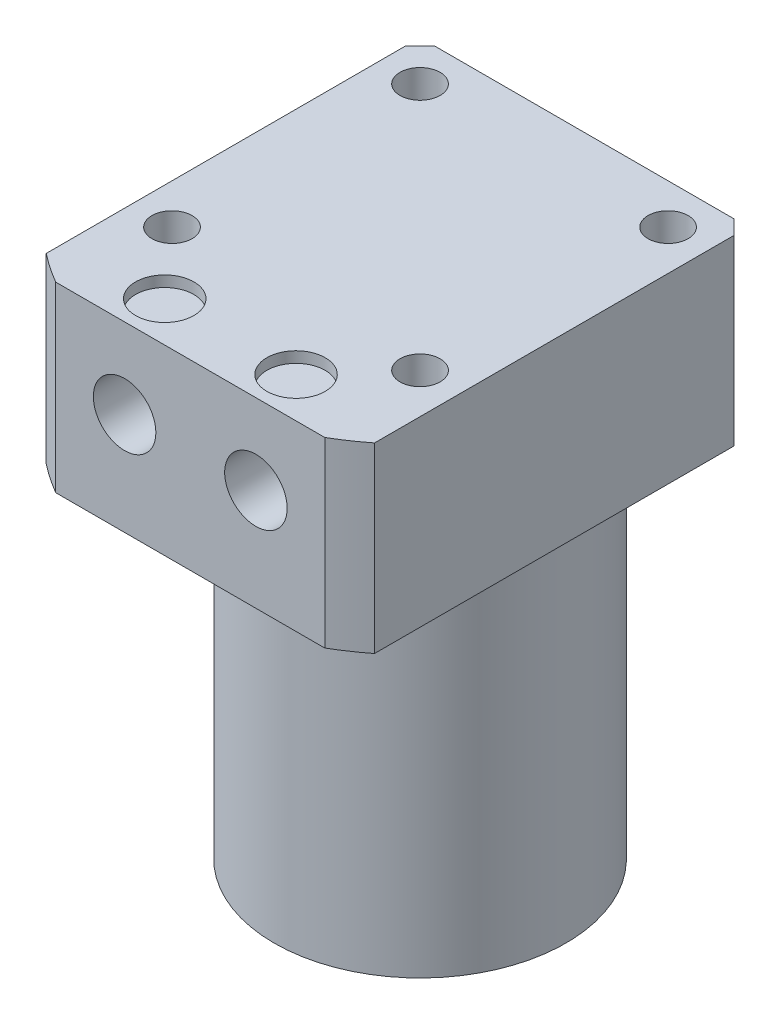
ISO-10303-21;
HEADER;
FILE_DESCRIPTION(('STEP AP214'),'2;1');
FILE_NAME('part.step','',(''),(''),'','','');
FILE_SCHEMA(('AUTOMOTIVE_DESIGN { 1 0 10303 214 1 1 1 1 }'));
ENDSEC;
DATA;
#1=APPLICATION_CONTEXT('core data for automotive mechanical design processes');
#2=APPLICATION_PROTOCOL_DEFINITION('international standard','automotive_design',2000,#1);
#3=PRODUCT_CONTEXT('',#1,'mechanical');
#4=PRODUCT('Part','Part','',(#3));
#5=PRODUCT_RELATED_PRODUCT_CATEGORY('part','',(#4));
#6=PRODUCT_DEFINITION_FORMATION('','',#4);
#7=PRODUCT_DEFINITION_CONTEXT('part definition',#1,'design');
#8=PRODUCT_DEFINITION('design','',#6,#7);
#9=PRODUCT_DEFINITION_SHAPE('','',#8);
#10=(LENGTH_UNIT() NAMED_UNIT(*) SI_UNIT(.MILLI.,.METRE.));
#11=(NAMED_UNIT(*) PLANE_ANGLE_UNIT() SI_UNIT($,.RADIAN.));
#12=(NAMED_UNIT(*) SI_UNIT($,.STERADIAN.) SOLID_ANGLE_UNIT());
#13=UNCERTAINTY_MEASURE_WITH_UNIT(LENGTH_MEASURE(1.E-05),#10,'distance_accuracy_value','');
#14=(GEOMETRIC_REPRESENTATION_CONTEXT(3) GLOBAL_UNCERTAINTY_ASSIGNED_CONTEXT((#13)) GLOBAL_UNIT_ASSIGNED_CONTEXT((#10,
#11,#12)) REPRESENTATION_CONTEXT('',''));
#15=CARTESIAN_POINT('',(0.,0.,0.));
#16=DIRECTION('',(0.,0.,1.));
#17=DIRECTION('',(1.,0.,0.));
#18=AXIS2_PLACEMENT_3D('',#15,#16,#17);
#19=CARTESIAN_POINT('',(-20.,50.,0.));
#20=DIRECTION('',(0.,-1.,0.));
#21=DIRECTION('',(0.,0.,-1.));
#22=AXIS2_PLACEMENT_3D('',#19,#20,#21);
#23=PLANE('',#22);
#24=CARTESIAN_POINT('',(-17.,50.,-17.));
#25=DIRECTION('',(0.,-1.,0.));
#26=DIRECTION('',(0.,0.,-1.));
#27=AXIS2_PLACEMENT_3D('',#24,#25,#26);
#28=CIRCLE('',#27,2.75);
#29=CARTESIAN_POINT('',(-17.,50.,-19.75));
#30=VERTEX_POINT('',#29);
#31=EDGE_CURVE('E288',#30,#30,#28,.T.);
#32=ORIENTED_EDGE('',*,*,#31,.F.);
#33=EDGE_LOOP('',(#32));
#34=FACE_BOUND('',#33,.T.);
#35=CARTESIAN_POINT('',(17.,50.,-17.));
#36=DIRECTION('',(0.,-1.,0.));
#37=DIRECTION('',(0.,0.,-1.));
#38=AXIS2_PLACEMENT_3D('',#35,#36,#37);
#39=CIRCLE('',#38,2.75);
#40=CARTESIAN_POINT('',(17.,50.,-19.75));
#41=VERTEX_POINT('',#40);
#42=EDGE_CURVE('E290',#41,#41,#39,.T.);
#43=ORIENTED_EDGE('',*,*,#42,.F.);
#44=EDGE_LOOP('',(#43));
#45=FACE_BOUND('',#44,.T.);
#46=CARTESIAN_POINT('',(17.,50.,17.));
#47=DIRECTION('',(0.,-1.,0.));
#48=DIRECTION('',(0.,0.,-1.));
#49=AXIS2_PLACEMENT_3D('',#46,#47,#48);
#50=CIRCLE('',#49,2.75);
#51=CARTESIAN_POINT('',(17.,50.,14.25));
#52=VERTEX_POINT('',#51);
#53=EDGE_CURVE('E298',#52,#52,#50,.T.);
#54=ORIENTED_EDGE('',*,*,#53,.F.);
#55=EDGE_LOOP('',(#54));
#56=FACE_BOUND('',#55,.T.);
#57=CARTESIAN_POINT('',(-17.,50.,17.));
#58=DIRECTION('',(0.,-1.,0.));
#59=DIRECTION('',(0.,0.,-1.));
#60=AXIS2_PLACEMENT_3D('',#57,#58,#59);
#61=CIRCLE('',#60,2.75);
#62=CARTESIAN_POINT('',(-17.,50.,14.25));
#63=VERTEX_POINT('',#62);
#64=EDGE_CURVE('E304',#63,#63,#61,.T.);
#65=ORIENTED_EDGE('',*,*,#64,.F.);
#66=EDGE_LOOP('',(#65));
#67=FACE_BOUND('',#66,.T.);
#68=CARTESIAN_POINT('',(0.,50.,0.));
#69=DIRECTION('',(0.,1.,0.));
#70=DIRECTION('',(0.,0.,1.));
#71=AXIS2_PLACEMENT_3D('',#68,#69,#70);
#72=CIRCLE('',#71,20.);
#73=CARTESIAN_POINT('',(0.,50.,20.));
#74=VERTEX_POINT('',#73);
#75=EDGE_CURVE('E134',#74,#74,#72,.T.);
#76=ORIENTED_EDGE('',*,*,#75,.T.);
#77=EDGE_LOOP('',(#76));
#78=FACE_BOUND('',#77,.T.);
#79=DIRECTION('',(1.,0.,0.));
#80=VECTOR('',#79,1.);
#81=CARTESIAN_POINT('',(-20.,50.,-22.5));
#82=LINE('',#81,#80);
#83=CARTESIAN_POINT('',(-20.5,50.,-22.5));
#84=VERTEX_POINT('',#83);
#85=CARTESIAN_POINT('',(20.5,50.,-22.5));
#86=VERTEX_POINT('',#85);
#87=EDGE_CURVE('E108',#84,#86,#82,.T.);
#88=ORIENTED_EDGE('',*,*,#87,.T.);
#89=DIRECTION('',(-0.70710678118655,0.,-0.707106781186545));
#90=VECTOR('',#89,1.);
#91=CARTESIAN_POINT('',(11.4999999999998,50.,-31.5000000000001));
#92=LINE('',#91,#90);
#93=CARTESIAN_POINT('',(22.5,50.,-20.5));
#94=VERTEX_POINT('',#93);
#95=EDGE_CURVE('E42',#86,#94,#92,.F.);
#96=ORIENTED_EDGE('',*,*,#95,.T.);
#97=DIRECTION('',(0.,0.,1.));
#98=VECTOR('',#97,1.);
#99=CARTESIAN_POINT('',(22.5,50.,0.));
#100=LINE('',#99,#98);
#101=CARTESIAN_POINT('',(22.5,50.,28.7402157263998));
#102=VERTEX_POINT('',#101);
#103=EDGE_CURVE('E123',#94,#102,#100,.T.);
#104=ORIENTED_EDGE('',*,*,#103,.T.);
#105=CARTESIAN_POINT('',(0.,50.,0.));
#106=DIRECTION('',(0.,1.,0.));
#107=DIRECTION('',(0.,0.,1.));
#108=AXIS2_PLACEMENT_3D('',#105,#106,#107);
#109=CIRCLE('',#108,36.5);
#110=CARTESIAN_POINT('',(18.4390889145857,50.,31.5));
#111=VERTEX_POINT('',#110);
#112=EDGE_CURVE('E131',#111,#102,#109,.T.);
#113=ORIENTED_EDGE('',*,*,#112,.F.);
#114=DIRECTION('',(-1.,0.,0.));
#115=VECTOR('',#114,1.);
#116=CARTESIAN_POINT('',(-20.,50.,31.5));
#117=LINE('',#116,#115);
#118=CARTESIAN_POINT('',(-18.4390889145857,50.,31.5));
#119=VERTEX_POINT('',#118);
#120=EDGE_CURVE('E178',#111,#119,#117,.T.);
#121=ORIENTED_EDGE('',*,*,#120,.T.);
#122=CARTESIAN_POINT('',(-22.5,50.,28.7402157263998));
#123=VERTEX_POINT('',#122);
#124=EDGE_CURVE('E126',#123,#119,#109,.T.);
#125=ORIENTED_EDGE('',*,*,#124,.F.);
#126=DIRECTION('',(0.,0.,-1.));
#127=VECTOR('',#126,1.);
#128=CARTESIAN_POINT('',(-22.5,50.,0.));
#129=LINE('',#128,#127);
#130=CARTESIAN_POINT('',(-22.5,50.,-20.5));
#131=VERTEX_POINT('',#130);
#132=EDGE_CURVE('E114',#123,#131,#129,.T.);
#133=ORIENTED_EDGE('',*,*,#132,.T.);
#134=DIRECTION('',(-0.707106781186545,0.,0.70710678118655));
#135=VECTOR('',#134,1.);
#136=CARTESIAN_POINT('',(-31.5,50.,-11.4999999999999));
#137=LINE('',#136,#135);
#138=EDGE_CURVE('E154',#131,#84,#137,.F.);
#139=ORIENTED_EDGE('',*,*,#138,.T.);
#140=EDGE_LOOP('',(#88,#96,#104,#113,#121,#125,#133,#139));
#141=FACE_BOUND('',#140,.T.);
#142=ADVANCED_FACE('F34',(#34,#45,#56,#67,#78,#141),#23,.T.);
#143=CARTESIAN_POINT('',(0.,87.0508296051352,0.));
#144=DIRECTION('',(0.,1.,0.));
#145=DIRECTION('',(0.,0.,1.));
#146=AXIS2_PLACEMENT_3D('',#143,#144,#145);
#147=CYLINDRICAL_SURFACE('',#146,36.5);
#148=ORIENTED_EDGE('',*,*,#112,.T.);
#149=DIRECTION('',(0.,1.,0.));
#150=VECTOR('',#149,1.);
#151=CARTESIAN_POINT('',(22.5,87.0508296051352,28.7402157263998));
#152=LINE('',#151,#150);
#153=CARTESIAN_POINT('',(22.5,75.,28.7402157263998));
#154=VERTEX_POINT('',#153);
#155=EDGE_CURVE('E127',#102,#154,#152,.T.);
#156=ORIENTED_EDGE('',*,*,#155,.T.);
#157=CARTESIAN_POINT('',(0.,75.,0.));
#158=DIRECTION('',(0.,1.,0.));
#159=DIRECTION('',(0.,0.,1.));
#160=AXIS2_PLACEMENT_3D('',#157,#158,#159);
#161=CIRCLE('',#160,36.5);
#162=CARTESIAN_POINT('',(18.4390889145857,75.,31.5));
#163=VERTEX_POINT('',#162);
#164=EDGE_CURVE('E122',#163,#154,#161,.T.);
#165=ORIENTED_EDGE('',*,*,#164,.F.);
#166=DIRECTION('',(0.,1.,0.));
#167=VECTOR('',#166,1.);
#168=CARTESIAN_POINT('',(18.4390889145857,87.0508296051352,31.5));
#169=LINE('',#168,#167);
#170=EDGE_CURVE('E181',#163,#111,#169,.F.);
#171=ORIENTED_EDGE('',*,*,#170,.T.);
#172=EDGE_LOOP('',(#148,#156,#165,#171));
#173=FACE_BOUND('',#172,.T.);
#174=ADVANCED_FACE('F185',(#173),#147,.T.);
#175=ORIENTED_EDGE('',*,*,#124,.T.);
#176=DIRECTION('',(0.,1.,0.));
#177=VECTOR('',#176,1.);
#178=CARTESIAN_POINT('',(-18.4390889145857,87.0508296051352,31.5));
#179=LINE('',#178,#177);
#180=CARTESIAN_POINT('',(-18.4390889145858,75.,31.5));
#181=VERTEX_POINT('',#180);
#182=EDGE_CURVE('E121',#119,#181,#179,.T.);
#183=ORIENTED_EDGE('',*,*,#182,.T.);
#184=CARTESIAN_POINT('',(-22.5,75.,28.7402157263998));
#185=VERTEX_POINT('',#184);
#186=EDGE_CURVE('E105',#185,#181,#161,.T.);
#187=ORIENTED_EDGE('',*,*,#186,.F.);
#188=DIRECTION('',(0.,1.,0.));
#189=VECTOR('',#188,1.);
#190=CARTESIAN_POINT('',(-22.5,87.0508296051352,28.7402157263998));
#191=LINE('',#190,#189);
#192=EDGE_CURVE('E112',#185,#123,#191,.F.);
#193=ORIENTED_EDGE('',*,*,#192,.T.);
#194=EDGE_LOOP('',(#175,#183,#187,#193));
#195=FACE_BOUND('',#194,.T.);
#196=ADVANCED_FACE('F120',(#195),#147,.T.);
#197=CARTESIAN_POINT('',(-36.5,75.,0.));
#198=DIRECTION('',(0.,1.,0.));
#199=DIRECTION('',(0.,0.,1.));
#200=AXIS2_PLACEMENT_3D('',#197,#198,#199);
#201=PLANE('',#200);
#202=CARTESIAN_POINT('',(-17.,75.,-17.));
#203=DIRECTION('',(0.,1.,0.));
#204=DIRECTION('',(0.,0.,1.));
#205=AXIS2_PLACEMENT_3D('',#202,#203,#204);
#206=CIRCLE('',#205,2.75);
#207=CARTESIAN_POINT('',(-17.,75.,-14.25));
#208=VERTEX_POINT('',#207);
#209=EDGE_CURVE('E286',#208,#208,#206,.T.);
#210=ORIENTED_EDGE('',*,*,#209,.F.);
#211=EDGE_LOOP('',(#210));
#212=FACE_BOUND('',#211,.T.);
#213=CARTESIAN_POINT('',(17.,75.,-17.));
#214=DIRECTION('',(0.,1.,0.));
#215=DIRECTION('',(0.,0.,1.));
#216=AXIS2_PLACEMENT_3D('',#213,#214,#215);
#217=CIRCLE('',#216,2.75);
#218=CARTESIAN_POINT('',(17.,75.,-14.25));
#219=VERTEX_POINT('',#218);
#220=EDGE_CURVE('E295',#219,#219,#217,.T.);
#221=ORIENTED_EDGE('',*,*,#220,.F.);
#222=EDGE_LOOP('',(#221));
#223=FACE_BOUND('',#222,.T.);
#224=CARTESIAN_POINT('',(17.,75.,17.));
#225=DIRECTION('',(0.,1.,0.));
#226=DIRECTION('',(0.,0.,1.));
#227=AXIS2_PLACEMENT_3D('',#224,#225,#226);
#228=CIRCLE('',#227,2.75);
#229=CARTESIAN_POINT('',(17.,75.,19.75));
#230=VERTEX_POINT('',#229);
#231=EDGE_CURVE('E301',#230,#230,#228,.T.);
#232=ORIENTED_EDGE('',*,*,#231,.F.);
#233=EDGE_LOOP('',(#232));
#234=FACE_BOUND('',#233,.T.);
#235=CARTESIAN_POINT('',(-17.,75.,17.));
#236=DIRECTION('',(0.,1.,0.));
#237=DIRECTION('',(0.,0.,1.));
#238=AXIS2_PLACEMENT_3D('',#235,#236,#237);
#239=CIRCLE('',#238,2.75);
#240=CARTESIAN_POINT('',(-17.,75.,19.75));
#241=VERTEX_POINT('',#240);
#242=EDGE_CURVE('E307',#241,#241,#239,.T.);
#243=ORIENTED_EDGE('',*,*,#242,.F.);
#244=EDGE_LOOP('',(#243));
#245=FACE_BOUND('',#244,.T.);
#246=CARTESIAN_POINT('',(-9.,75.,26.));
#247=DIRECTION('',(0.,1.,0.));
#248=DIRECTION('',(0.,0.,1.));
#249=AXIS2_PLACEMENT_3D('',#246,#247,#248);
#250=CIRCLE('',#249,4.);
#251=CARTESIAN_POINT('',(-9.,75.,30.));
#252=VERTEX_POINT('',#251);
#253=EDGE_CURVE('E322',#252,#252,#250,.T.);
#254=ORIENTED_EDGE('',*,*,#253,.F.);
#255=EDGE_LOOP('',(#254));
#256=FACE_BOUND('',#255,.T.);
#257=CARTESIAN_POINT('',(8.99999999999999,75.,26.));
#258=DIRECTION('',(0.,1.,0.));
#259=DIRECTION('',(0.,0.,1.));
#260=AXIS2_PLACEMENT_3D('',#257,#258,#259);
#261=CIRCLE('',#260,4.);
#262=CARTESIAN_POINT('',(8.99999999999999,75.,30.));
#263=VERTEX_POINT('',#262);
#264=EDGE_CURVE('E171',#263,#263,#261,.T.);
#265=ORIENTED_EDGE('',*,*,#264,.F.);
#266=EDGE_LOOP('',(#265));
#267=FACE_BOUND('',#266,.T.);
#268=DIRECTION('',(0.,0.,-1.));
#269=VECTOR('',#268,1.);
#270=CARTESIAN_POINT('',(22.5,75.,0.));
#271=LINE('',#270,#269);
#272=CARTESIAN_POINT('',(22.5,75.,-20.5));
#273=VERTEX_POINT('',#272);
#274=EDGE_CURVE('E140',#154,#273,#271,.T.);
#275=ORIENTED_EDGE('',*,*,#274,.T.);
#276=DIRECTION('',(0.70710678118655,0.,0.707106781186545));
#277=VECTOR('',#276,1.);
#278=CARTESIAN_POINT('',(3.24999999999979,75.,-39.7500000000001));
#279=LINE('',#278,#277);
#280=CARTESIAN_POINT('',(20.5,75.,-22.5));
#281=VERTEX_POINT('',#280);
#282=EDGE_CURVE('E148',#273,#281,#279,.F.);
#283=ORIENTED_EDGE('',*,*,#282,.T.);
#284=DIRECTION('',(-1.,0.,0.));
#285=VECTOR('',#284,1.);
#286=CARTESIAN_POINT('',(-22.5,75.,-22.5));
#287=LINE('',#286,#285);
#288=CARTESIAN_POINT('',(-20.5,75.,-22.5));
#289=VERTEX_POINT('',#288);
#290=EDGE_CURVE('E109',#281,#289,#287,.T.);
#291=ORIENTED_EDGE('',*,*,#290,.T.);
#292=DIRECTION('',(0.707106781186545,0.,-0.70710678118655));
#293=VECTOR('',#292,1.);
#294=CARTESIAN_POINT('',(-39.7499999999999,75.,-3.24999999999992));
#295=LINE('',#294,#293);
#296=CARTESIAN_POINT('',(-22.5,75.,-20.5));
#297=VERTEX_POINT('',#296);
#298=EDGE_CURVE('E107',#289,#297,#295,.F.);
#299=ORIENTED_EDGE('',*,*,#298,.T.);
#300=DIRECTION('',(0.,0.,1.));
#301=VECTOR('',#300,1.);
#302=CARTESIAN_POINT('',(-22.5,75.,-22.5));
#303=LINE('',#302,#301);
#304=EDGE_CURVE('E99',#297,#185,#303,.T.);
#305=ORIENTED_EDGE('',*,*,#304,.T.);
#306=ORIENTED_EDGE('',*,*,#186,.T.);
#307=DIRECTION('',(1.,0.,0.));
#308=VECTOR('',#307,1.);
#309=CARTESIAN_POINT('',(-36.5,75.,31.5));
#310=LINE('',#309,#308);
#311=EDGE_CURVE('E142',#181,#163,#310,.T.);
#312=ORIENTED_EDGE('',*,*,#311,.T.);
#313=ORIENTED_EDGE('',*,*,#164,.T.);
#314=EDGE_LOOP('',(#275,#283,#291,#299,#305,#306,#312,#313));
#315=FACE_BOUND('',#314,.T.);
#316=ADVANCED_FACE('F102',(#212,#223,#234,#245,#256,#267,#315),#201,.T.);
#317=CARTESIAN_POINT('',(0.,0.,0.));
#318=DIRECTION('',(0.,-1.,0.));
#319=DIRECTION('',(0.,0.,-1.));
#320=AXIS2_PLACEMENT_3D('',#317,#318,#319);
#321=PLANE('',#320);
#322=CARTESIAN_POINT('',(0.,0.,0.));
#323=DIRECTION('',(0.,1.,0.));
#324=DIRECTION('',(0.,0.,1.));
#325=AXIS2_PLACEMENT_3D('',#322,#323,#324);
#326=CIRCLE('',#325,20.);
#327=CARTESIAN_POINT('',(0.,0.,20.));
#328=VERTEX_POINT('',#327);
#329=EDGE_CURVE('E137',#328,#328,#326,.T.);
#330=ORIENTED_EDGE('',*,*,#329,.F.);
#331=EDGE_LOOP('',(#330));
#332=FACE_BOUND('',#331,.T.);
#333=ADVANCED_FACE('F213',(#332),#321,.T.);
#334=CARTESIAN_POINT('',(0.,87.0508296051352,0.));
#335=DIRECTION('',(0.,1.,0.));
#336=DIRECTION('',(0.,0.,1.));
#337=AXIS2_PLACEMENT_3D('',#334,#335,#336);
#338=CYLINDRICAL_SURFACE('',#337,20.);
#339=ORIENTED_EDGE('',*,*,#329,.T.);
#340=EDGE_LOOP('',(#339));
#341=FACE_BOUND('',#340,.T.);
#342=ORIENTED_EDGE('',*,*,#75,.F.);
#343=EDGE_LOOP('',(#342));
#344=FACE_BOUND('',#343,.T.);
#345=ADVANCED_FACE('F210',(#341,#344),#338,.T.);
#346=CARTESIAN_POINT('',(-22.5,0.,-22.5));
#347=DIRECTION('',(0.,0.,-1.));
#348=DIRECTION('',(-1.,0.,0.));
#349=AXIS2_PLACEMENT_3D('',#346,#347,#348);
#350=PLANE('',#349);
#351=ORIENTED_EDGE('',*,*,#290,.F.);
#352=DIRECTION('',(0.,-1.,0.));
#353=VECTOR('',#352,1.);
#354=CARTESIAN_POINT('',(20.5,0.,-22.5));
#355=LINE('',#354,#353);
#356=EDGE_CURVE('E55',#281,#86,#355,.T.);
#357=ORIENTED_EDGE('',*,*,#356,.T.);
#358=ORIENTED_EDGE('',*,*,#87,.F.);
#359=DIRECTION('',(0.,1.,0.));
#360=VECTOR('',#359,1.);
#361=CARTESIAN_POINT('',(-20.5,0.,-22.5));
#362=LINE('',#361,#360);
#363=EDGE_CURVE('E150',#84,#289,#362,.T.);
#364=ORIENTED_EDGE('',*,*,#363,.T.);
#365=EDGE_LOOP('',(#351,#357,#358,#364));
#366=FACE_BOUND('',#365,.T.);
#367=ADVANCED_FACE('F166',(#366),#350,.T.);
#368=CARTESIAN_POINT('',(-22.5,0.,-22.5));
#369=DIRECTION('',(-1.,0.,0.));
#370=DIRECTION('',(0.,0.,1.));
#371=AXIS2_PLACEMENT_3D('',#368,#369,#370);
#372=PLANE('',#371);
#373=ORIENTED_EDGE('',*,*,#304,.F.);
#374=DIRECTION('',(0.,-1.,0.));
#375=VECTOR('',#374,1.);
#376=CARTESIAN_POINT('',(-22.5,0.,-20.5));
#377=LINE('',#376,#375);
#378=EDGE_CURVE('E12',#297,#131,#377,.T.);
#379=ORIENTED_EDGE('',*,*,#378,.T.);
#380=ORIENTED_EDGE('',*,*,#132,.F.);
#381=ORIENTED_EDGE('',*,*,#192,.F.);
#382=EDGE_LOOP('',(#373,#379,#380,#381));
#383=FACE_BOUND('',#382,.T.);
#384=ADVANCED_FACE('F113',(#383),#372,.T.);
#385=CARTESIAN_POINT('',(22.5,0.,-22.5));
#386=DIRECTION('',(1.,0.,0.));
#387=DIRECTION('',(0.,0.,-1.));
#388=AXIS2_PLACEMENT_3D('',#385,#386,#387);
#389=PLANE('',#388);
#390=ORIENTED_EDGE('',*,*,#103,.F.);
#391=DIRECTION('',(0.,1.,0.));
#392=VECTOR('',#391,1.);
#393=CARTESIAN_POINT('',(22.5,0.,-20.5));
#394=LINE('',#393,#392);
#395=EDGE_CURVE('E144',#94,#273,#394,.T.);
#396=ORIENTED_EDGE('',*,*,#395,.T.);
#397=ORIENTED_EDGE('',*,*,#274,.F.);
#398=ORIENTED_EDGE('',*,*,#155,.F.);
#399=EDGE_LOOP('',(#390,#396,#397,#398));
#400=FACE_BOUND('',#399,.T.);
#401=ADVANCED_FACE('F163',(#400),#389,.T.);
#402=CARTESIAN_POINT('',(-22.5,0.,31.5));
#403=DIRECTION('',(0.,0.,1.));
#404=DIRECTION('',(1.,0.,0.));
#405=AXIS2_PLACEMENT_3D('',#402,#403,#404);
#406=PLANE('',#405);
#407=CARTESIAN_POINT('',(-9.,64.,31.5));
#408=DIRECTION('',(0.,0.,1.));
#409=DIRECTION('',(1.,0.,0.));
#410=AXIS2_PLACEMENT_3D('',#407,#408,#409);
#411=CIRCLE('',#410,4.283);
#412=CARTESIAN_POINT('',(-4.717,64.,31.5));
#413=VERTEX_POINT('',#412);
#414=EDGE_CURVE('E310',#413,#413,#411,.T.);
#415=ORIENTED_EDGE('',*,*,#414,.F.);
#416=EDGE_LOOP('',(#415));
#417=FACE_BOUND('',#416,.T.);
#418=CARTESIAN_POINT('',(9.,64.,31.5));
#419=DIRECTION('',(0.,0.,1.));
#420=DIRECTION('',(1.,0.,0.));
#421=AXIS2_PLACEMENT_3D('',#418,#419,#420);
#422=CIRCLE('',#421,4.283);
#423=CARTESIAN_POINT('',(13.283,64.,31.5));
#424=VERTEX_POINT('',#423);
#425=EDGE_CURVE('E316',#424,#424,#422,.T.);
#426=ORIENTED_EDGE('',*,*,#425,.F.);
#427=EDGE_LOOP('',(#426));
#428=FACE_BOUND('',#427,.T.);
#429=ORIENTED_EDGE('',*,*,#311,.F.);
#430=ORIENTED_EDGE('',*,*,#182,.F.);
#431=ORIENTED_EDGE('',*,*,#120,.F.);
#432=ORIENTED_EDGE('',*,*,#170,.F.);
#433=EDGE_LOOP('',(#429,#430,#431,#432));
#434=FACE_BOUND('',#433,.T.);
#435=ADVANCED_FACE('F187',(#417,#428,#434),#406,.T.);
#436=CARTESIAN_POINT('',(22.5,0.,-20.5));
#437=DIRECTION('',(-0.707106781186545,0.,0.70710678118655));
#438=DIRECTION('',(0.70710678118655,0.,0.707106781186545));
#439=AXIS2_PLACEMENT_3D('',#436,#437,#438);
#440=PLANE('',#439);
#441=ORIENTED_EDGE('',*,*,#95,.F.);
#442=ORIENTED_EDGE('',*,*,#356,.F.);
#443=ORIENTED_EDGE('',*,*,#282,.F.);
#444=ORIENTED_EDGE('',*,*,#395,.F.);
#445=EDGE_LOOP('',(#441,#442,#443,#444));
#446=FACE_BOUND('',#445,.T.);
#447=ADVANCED_FACE('F165',(#446),#440,.F.);
#448=CARTESIAN_POINT('',(-20.5,0.,-22.5));
#449=DIRECTION('',(0.70710678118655,0.,0.707106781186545));
#450=DIRECTION('',(0.707106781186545,0.,-0.70710678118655));
#451=AXIS2_PLACEMENT_3D('',#448,#449,#450);
#452=PLANE('',#451);
#453=ORIENTED_EDGE('',*,*,#138,.F.);
#454=ORIENTED_EDGE('',*,*,#378,.F.);
#455=ORIENTED_EDGE('',*,*,#298,.F.);
#456=ORIENTED_EDGE('',*,*,#363,.F.);
#457=EDGE_LOOP('',(#453,#454,#455,#456));
#458=FACE_BOUND('',#457,.T.);
#459=ADVANCED_FACE('F36',(#458),#452,.F.);
#460=CARTESIAN_POINT('',(8.99999999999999,73.5,26.));
#461=DIRECTION('',(0.,-1.,0.));
#462=DIRECTION('',(0.,0.,-1.));
#463=AXIS2_PLACEMENT_3D('',#460,#461,#462);
#464=PLANE('',#463);
#465=CARTESIAN_POINT('',(8.99999999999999,73.5,26.));
#466=DIRECTION('',(0.,1.,0.));
#467=DIRECTION('',(0.,0.,1.));
#468=AXIS2_PLACEMENT_3D('',#465,#466,#467);
#469=CIRCLE('',#468,4.);
#470=CARTESIAN_POINT('',(8.99999999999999,73.5,30.));
#471=VERTEX_POINT('',#470);
#472=EDGE_CURVE('E168',#471,#471,#469,.T.);
#473=ORIENTED_EDGE('',*,*,#472,.T.);
#474=EDGE_LOOP('',(#473));
#475=FACE_BOUND('',#474,.T.);
#476=ADVANCED_FACE('F191',(#475),#464,.F.);
#477=CARTESIAN_POINT('',(8.99999999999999,75.,26.));
#478=DIRECTION('',(0.,1.,0.));
#479=DIRECTION('',(0.,0.,1.));
#480=AXIS2_PLACEMENT_3D('',#477,#478,#479);
#481=CYLINDRICAL_SURFACE('',#480,4.);
#482=ORIENTED_EDGE('',*,*,#472,.F.);
#483=EDGE_LOOP('',(#482));
#484=FACE_BOUND('',#483,.T.);
#485=ORIENTED_EDGE('',*,*,#264,.T.);
#486=EDGE_LOOP('',(#485));
#487=FACE_BOUND('',#486,.T.);
#488=ADVANCED_FACE('F196',(#484,#487),#481,.F.);
#489=CARTESIAN_POINT('',(-9.,73.5,26.));
#490=DIRECTION('',(0.,-1.,0.));
#491=DIRECTION('',(0.,0.,-1.));
#492=AXIS2_PLACEMENT_3D('',#489,#490,#491);
#493=PLANE('',#492);
#494=CARTESIAN_POINT('',(-9.,73.5,26.));
#495=DIRECTION('',(0.,1.,0.));
#496=DIRECTION('',(0.,0.,1.));
#497=AXIS2_PLACEMENT_3D('',#494,#495,#496);
#498=CIRCLE('',#497,4.);
#499=CARTESIAN_POINT('',(-9.,73.5,30.));
#500=VERTEX_POINT('',#499);
#501=EDGE_CURVE('E325',#500,#500,#498,.T.);
#502=ORIENTED_EDGE('',*,*,#501,.T.);
#503=EDGE_LOOP('',(#502));
#504=FACE_BOUND('',#503,.T.);
#505=ADVANCED_FACE('F242',(#504),#493,.F.);
#506=CARTESIAN_POINT('',(-9.,75.,26.));
#507=DIRECTION('',(0.,1.,0.));
#508=DIRECTION('',(0.,0.,1.));
#509=AXIS2_PLACEMENT_3D('',#506,#507,#508);
#510=CYLINDRICAL_SURFACE('',#509,4.);
#511=ORIENTED_EDGE('',*,*,#501,.F.);
#512=EDGE_LOOP('',(#511));
#513=FACE_BOUND('',#512,.T.);
#514=ORIENTED_EDGE('',*,*,#253,.T.);
#515=EDGE_LOOP('',(#514));
#516=FACE_BOUND('',#515,.T.);
#517=ADVANCED_FACE('F246',(#513,#516),#510,.F.);
#518=CARTESIAN_POINT('',(8.99999999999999,64.,9.32));
#519=DIRECTION('',(0.,0.,-1.));
#520=DIRECTION('',(-1.,0.,0.));
#521=AXIS2_PLACEMENT_3D('',#518,#519,#520);
#522=PLANE('',#521);
#523=CARTESIAN_POINT('',(9.,64.,9.32));
#524=DIRECTION('',(0.,0.,1.));
#525=DIRECTION('',(1.,0.,0.));
#526=AXIS2_PLACEMENT_3D('',#523,#524,#525);
#527=CIRCLE('',#526,4.283);
#528=CARTESIAN_POINT('',(13.283,64.,9.32));
#529=VERTEX_POINT('',#528);
#530=EDGE_CURVE('E319',#529,#529,#527,.T.);
#531=ORIENTED_EDGE('',*,*,#530,.T.);
#532=EDGE_LOOP('',(#531));
#533=FACE_BOUND('',#532,.T.);
#534=ADVANCED_FACE('F250',(#533),#522,.F.);
#535=CARTESIAN_POINT('',(9.,64.,31.5));
#536=DIRECTION('',(0.,0.,1.));
#537=DIRECTION('',(1.,0.,0.));
#538=AXIS2_PLACEMENT_3D('',#535,#536,#537);
#539=CYLINDRICAL_SURFACE('',#538,4.283);
#540=ORIENTED_EDGE('',*,*,#530,.F.);
#541=EDGE_LOOP('',(#540));
#542=FACE_BOUND('',#541,.T.);
#543=ORIENTED_EDGE('',*,*,#425,.T.);
#544=EDGE_LOOP('',(#543));
#545=FACE_BOUND('',#544,.T.);
#546=ADVANCED_FACE('F254',(#542,#545),#539,.F.);
#547=CARTESIAN_POINT('',(-9.00000000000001,64.,9.32));
#548=DIRECTION('',(0.,0.,-1.));
#549=DIRECTION('',(-1.,0.,0.));
#550=AXIS2_PLACEMENT_3D('',#547,#548,#549);
#551=PLANE('',#550);
#552=CARTESIAN_POINT('',(-9.,64.,9.32));
#553=DIRECTION('',(0.,0.,1.));
#554=DIRECTION('',(1.,0.,0.));
#555=AXIS2_PLACEMENT_3D('',#552,#553,#554);
#556=CIRCLE('',#555,4.283);
#557=CARTESIAN_POINT('',(-4.717,64.,9.32));
#558=VERTEX_POINT('',#557);
#559=EDGE_CURVE('E313',#558,#558,#556,.T.);
#560=ORIENTED_EDGE('',*,*,#559,.T.);
#561=EDGE_LOOP('',(#560));
#562=FACE_BOUND('',#561,.T.);
#563=ADVANCED_FACE('F258',(#562),#551,.F.);
#564=CARTESIAN_POINT('',(-9.,64.,31.5));
#565=DIRECTION('',(0.,0.,1.));
#566=DIRECTION('',(1.,0.,0.));
#567=AXIS2_PLACEMENT_3D('',#564,#565,#566);
#568=CYLINDRICAL_SURFACE('',#567,4.283);
#569=ORIENTED_EDGE('',*,*,#559,.F.);
#570=EDGE_LOOP('',(#569));
#571=FACE_BOUND('',#570,.T.);
#572=ORIENTED_EDGE('',*,*,#414,.T.);
#573=EDGE_LOOP('',(#572));
#574=FACE_BOUND('',#573,.T.);
#575=ADVANCED_FACE('F262',(#571,#574),#568,.F.);
#576=CARTESIAN_POINT('',(-17.,50.,17.));
#577=DIRECTION('',(0.,-1.,0.));
#578=DIRECTION('',(0.,0.,-1.));
#579=AXIS2_PLACEMENT_3D('',#576,#577,#578);
#580=CYLINDRICAL_SURFACE('',#579,2.75);
#581=ORIENTED_EDGE('',*,*,#242,.T.);
#582=EDGE_LOOP('',(#581));
#583=FACE_BOUND('',#582,.T.);
#584=ORIENTED_EDGE('',*,*,#64,.T.);
#585=EDGE_LOOP('',(#584));
#586=FACE_BOUND('',#585,.T.);
#587=ADVANCED_FACE('F266',(#583,#586),#580,.F.);
#588=CARTESIAN_POINT('',(17.,50.,17.));
#589=DIRECTION('',(0.,-1.,0.));
#590=DIRECTION('',(0.,0.,-1.));
#591=AXIS2_PLACEMENT_3D('',#588,#589,#590);
#592=CYLINDRICAL_SURFACE('',#591,2.75);
#593=ORIENTED_EDGE('',*,*,#231,.T.);
#594=EDGE_LOOP('',(#593));
#595=FACE_BOUND('',#594,.T.);
#596=ORIENTED_EDGE('',*,*,#53,.T.);
#597=EDGE_LOOP('',(#596));
#598=FACE_BOUND('',#597,.T.);
#599=ADVANCED_FACE('F270',(#595,#598),#592,.F.);
#600=CARTESIAN_POINT('',(17.,50.,-17.));
#601=DIRECTION('',(0.,-1.,0.));
#602=DIRECTION('',(0.,0.,-1.));
#603=AXIS2_PLACEMENT_3D('',#600,#601,#602);
#604=CYLINDRICAL_SURFACE('',#603,2.75);
#605=ORIENTED_EDGE('',*,*,#220,.T.);
#606=EDGE_LOOP('',(#605));
#607=FACE_BOUND('',#606,.T.);
#608=ORIENTED_EDGE('',*,*,#42,.T.);
#609=EDGE_LOOP('',(#608));
#610=FACE_BOUND('',#609,.T.);
#611=ADVANCED_FACE('F274',(#607,#610),#604,.F.);
#612=CARTESIAN_POINT('',(-17.,50.,-17.));
#613=DIRECTION('',(0.,-1.,0.));
#614=DIRECTION('',(0.,0.,-1.));
#615=AXIS2_PLACEMENT_3D('',#612,#613,#614);
#616=CYLINDRICAL_SURFACE('',#615,2.75);
#617=ORIENTED_EDGE('',*,*,#209,.T.);
#618=EDGE_LOOP('',(#617));
#619=FACE_BOUND('',#618,.T.);
#620=ORIENTED_EDGE('',*,*,#31,.T.);
#621=EDGE_LOOP('',(#620));
#622=FACE_BOUND('',#621,.T.);
#623=ADVANCED_FACE('F278',(#619,#622),#616,.F.);
#624=CLOSED_SHELL('',(#142,#174,#196,#316,#333,#345,#367,#384,#401,#435,#447,#459,#476,#488,
#505,#517,#534,#546,#563,#575,#587,#599,#611,#623));
#625=MANIFOLD_SOLID_BREP('B2',#624);
#626=ADVANCED_BREP_SHAPE_REPRESENTATION('',(#18,#625),#14);
#627=SHAPE_DEFINITION_REPRESENTATION(#9,#626);
ENDSEC;
END-ISO-10303-21;
